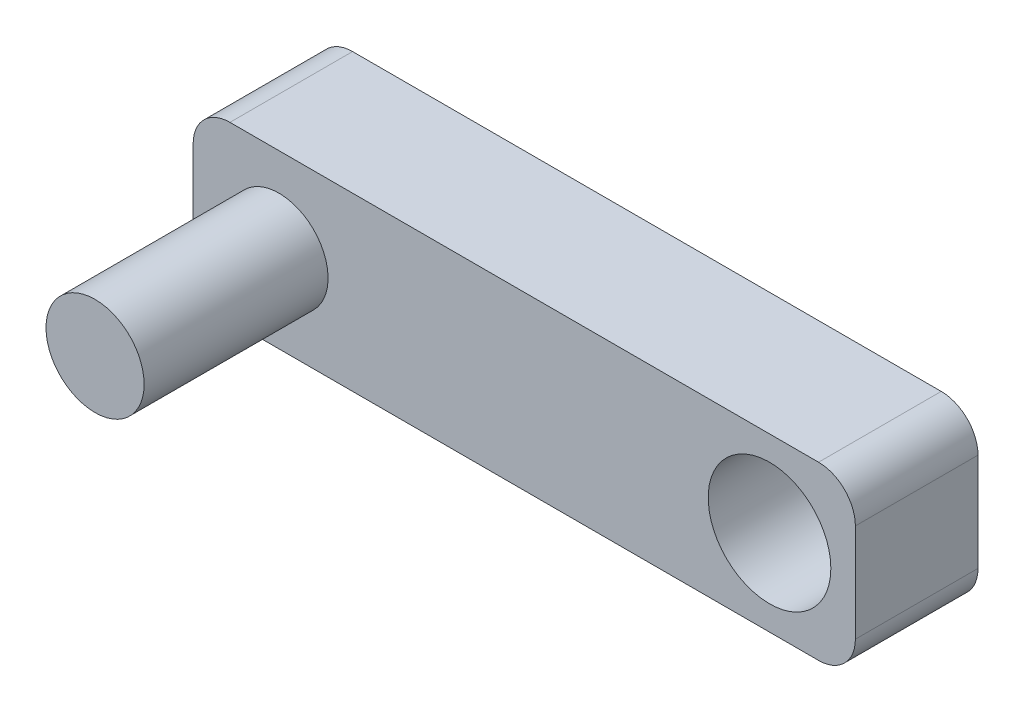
ISO-10303-21;
HEADER;
FILE_DESCRIPTION(('STEP AP214'),'2;1');
FILE_NAME('part.step','',(''),(''),'','','');
FILE_SCHEMA(('AUTOMOTIVE_DESIGN { 1 0 10303 214 1 1 1 1 }'));
ENDSEC;
DATA;
#1=APPLICATION_CONTEXT('core data for automotive mechanical design processes');
#2=APPLICATION_PROTOCOL_DEFINITION('international standard','automotive_design',2000,#1);
#3=PRODUCT_CONTEXT('',#1,'mechanical');
#4=PRODUCT('Part','Part','',(#3));
#5=PRODUCT_RELATED_PRODUCT_CATEGORY('part','',(#4));
#6=PRODUCT_DEFINITION_FORMATION('','',#4);
#7=PRODUCT_DEFINITION_CONTEXT('part definition',#1,'design');
#8=PRODUCT_DEFINITION('design','',#6,#7);
#9=PRODUCT_DEFINITION_SHAPE('','',#8);
#10=(LENGTH_UNIT() NAMED_UNIT(*) SI_UNIT(.MILLI.,.METRE.));
#11=(NAMED_UNIT(*) PLANE_ANGLE_UNIT() SI_UNIT($,.RADIAN.));
#12=(NAMED_UNIT(*) SI_UNIT($,.STERADIAN.) SOLID_ANGLE_UNIT());
#13=UNCERTAINTY_MEASURE_WITH_UNIT(LENGTH_MEASURE(1.E-05),#10,'distance_accuracy_value','');
#14=(GEOMETRIC_REPRESENTATION_CONTEXT(3) GLOBAL_UNCERTAINTY_ASSIGNED_CONTEXT((#13)) GLOBAL_UNIT_ASSIGNED_CONTEXT((#10,
#11,#12)) REPRESENTATION_CONTEXT('',''));
#15=CARTESIAN_POINT('',(0.,0.,0.));
#16=DIRECTION('',(0.,0.,1.));
#17=DIRECTION('',(1.,0.,0.));
#18=AXIS2_PLACEMENT_3D('',#15,#16,#17);
#19=CARTESIAN_POINT('',(0.,140.,100.));
#20=DIRECTION('',(0.,0.,-1.));
#21=DIRECTION('',(-1.,0.,0.));
#22=AXIS2_PLACEMENT_3D('',#19,#20,#21);
#23=PLANE('',#22);
#24=DIRECTION('',(1.,0.,0.));
#25=VECTOR('',#24,1.);
#26=CARTESIAN_POINT('',(0.,0.,100.));
#27=LINE('',#26,#25);
#28=CARTESIAN_POINT('',(30.,0.,100.));
#29=VERTEX_POINT('',#28);
#30=CARTESIAN_POINT('',(510.,0.,100.));
#31=VERTEX_POINT('',#30);
#32=EDGE_CURVE('E173',#29,#31,#27,.T.);
#33=ORIENTED_EDGE('',*,*,#32,.T.);
#34=CARTESIAN_POINT('',(510.,30.,100.));
#35=DIRECTION('',(0.,0.,-1.));
#36=DIRECTION('',(-1.,0.,0.));
#37=AXIS2_PLACEMENT_3D('',#34,#35,#36);
#38=CIRCLE('',#37,30.);
#39=CARTESIAN_POINT('',(540.,30.,100.));
#40=VERTEX_POINT('',#39);
#41=EDGE_CURVE('E150',#31,#40,#38,.F.);
#42=ORIENTED_EDGE('',*,*,#41,.T.);
#43=DIRECTION('',(0.,1.,0.));
#44=VECTOR('',#43,1.);
#45=CARTESIAN_POINT('',(540.,0.,100.));
#46=LINE('',#45,#44);
#47=CARTESIAN_POINT('',(540.,110.,100.));
#48=VERTEX_POINT('',#47);
#49=EDGE_CURVE('E118',#40,#48,#46,.T.);
#50=ORIENTED_EDGE('',*,*,#49,.T.);
#51=CARTESIAN_POINT('',(510.,110.,100.));
#52=DIRECTION('',(0.,0.,-1.));
#53=DIRECTION('',(-1.,0.,0.));
#54=AXIS2_PLACEMENT_3D('',#51,#52,#53);
#55=CIRCLE('',#54,30.);
#56=CARTESIAN_POINT('',(510.,140.,100.));
#57=VERTEX_POINT('',#56);
#58=EDGE_CURVE('E55',#48,#57,#55,.F.);
#59=ORIENTED_EDGE('',*,*,#58,.T.);
#60=DIRECTION('',(-1.,0.,0.));
#61=VECTOR('',#60,1.);
#62=CARTESIAN_POINT('',(0.,140.,100.));
#63=LINE('',#62,#61);
#64=CARTESIAN_POINT('',(30.,140.,100.));
#65=VERTEX_POINT('',#64);
#66=EDGE_CURVE('E136',#57,#65,#63,.T.);
#67=ORIENTED_EDGE('',*,*,#66,.T.);
#68=CARTESIAN_POINT('',(30.,110.,100.));
#69=DIRECTION('',(0.,0.,-1.));
#70=DIRECTION('',(-1.,0.,0.));
#71=AXIS2_PLACEMENT_3D('',#68,#69,#70);
#72=CIRCLE('',#71,30.);
#73=CARTESIAN_POINT('',(0.,110.,100.));
#74=VERTEX_POINT('',#73);
#75=EDGE_CURVE('E145',#65,#74,#72,.F.);
#76=ORIENTED_EDGE('',*,*,#75,.T.);
#77=DIRECTION('',(0.,-1.,0.));
#78=VECTOR('',#77,1.);
#79=CARTESIAN_POINT('',(0.,0.,100.));
#80=LINE('',#79,#78);
#81=CARTESIAN_POINT('',(0.,30.,100.));
#82=VERTEX_POINT('',#81);
#83=EDGE_CURVE('E127',#74,#82,#80,.T.);
#84=ORIENTED_EDGE('',*,*,#83,.T.);
#85=CARTESIAN_POINT('',(30.,30.,100.));
#86=DIRECTION('',(0.,0.,-1.));
#87=DIRECTION('',(-1.,0.,0.));
#88=AXIS2_PLACEMENT_3D('',#85,#86,#87);
#89=CIRCLE('',#88,30.);
#90=EDGE_CURVE('E147',#82,#29,#89,.F.);
#91=ORIENTED_EDGE('',*,*,#90,.T.);
#92=EDGE_LOOP('',(#33,#42,#50,#59,#67,#76,#84,#91));
#93=FACE_BOUND('',#92,.T.);
#94=CARTESIAN_POINT('',(470.,70.,100.));
#95=DIRECTION('',(0.,0.,1.));
#96=DIRECTION('',(1.,0.,0.));
#97=AXIS2_PLACEMENT_3D('',#94,#95,#96);
#98=CIRCLE('',#97,50.);
#99=CARTESIAN_POINT('',(520.,70.,100.));
#100=VERTEX_POINT('',#99);
#101=EDGE_CURVE('E168',#100,#100,#98,.T.);
#102=ORIENTED_EDGE('',*,*,#101,.F.);
#103=EDGE_LOOP('',(#102));
#104=FACE_BOUND('',#103,.T.);
#105=CARTESIAN_POINT('',(70.,70.,100.));
#106=DIRECTION('',(0.,0.,-1.));
#107=DIRECTION('',(-1.,0.,0.));
#108=AXIS2_PLACEMENT_3D('',#105,#106,#107);
#109=CIRCLE('',#108,40.);
#110=CARTESIAN_POINT('',(30.,70.,100.));
#111=VERTEX_POINT('',#110);
#112=EDGE_CURVE('E133',#111,#111,#109,.F.);
#113=ORIENTED_EDGE('',*,*,#112,.F.);
#114=EDGE_LOOP('',(#113));
#115=FACE_BOUND('',#114,.T.);
#116=ADVANCED_FACE('F33',(#93,#104,#115),#23,.F.);
#117=CARTESIAN_POINT('',(0.,0.,100.));
#118=DIRECTION('',(1.,0.,0.));
#119=DIRECTION('',(0.,0.,-1.));
#120=AXIS2_PLACEMENT_3D('',#117,#118,#119);
#121=PLANE('',#120);
#122=DIRECTION('',(0.,-1.,0.));
#123=VECTOR('',#122,1.);
#124=CARTESIAN_POINT('',(0.,0.,0.));
#125=LINE('',#124,#123);
#126=CARTESIAN_POINT('',(0.,110.,0.));
#127=VERTEX_POINT('',#126);
#128=CARTESIAN_POINT('',(0.,30.,0.));
#129=VERTEX_POINT('',#128);
#130=EDGE_CURVE('E129',#127,#129,#125,.T.);
#131=ORIENTED_EDGE('',*,*,#130,.T.);
#132=DIRECTION('',(0.,0.,-1.));
#133=VECTOR('',#132,1.);
#134=CARTESIAN_POINT('',(0.,30.,100.));
#135=LINE('',#134,#133);
#136=EDGE_CURVE('E11',#129,#82,#135,.F.);
#137=ORIENTED_EDGE('',*,*,#136,.T.);
#138=ORIENTED_EDGE('',*,*,#83,.F.);
#139=DIRECTION('',(0.,0.,-1.));
#140=VECTOR('',#139,1.);
#141=CARTESIAN_POINT('',(0.,110.,100.));
#142=LINE('',#141,#140);
#143=EDGE_CURVE('E41',#74,#127,#142,.T.);
#144=ORIENTED_EDGE('',*,*,#143,.T.);
#145=EDGE_LOOP('',(#131,#137,#138,#144));
#146=FACE_BOUND('',#145,.T.);
#147=ADVANCED_FACE('F161',(#146),#121,.F.);
#148=CARTESIAN_POINT('',(0.,0.,100.));
#149=DIRECTION('',(0.,1.,0.));
#150=DIRECTION('',(0.,0.,1.));
#151=AXIS2_PLACEMENT_3D('',#148,#149,#150);
#152=PLANE('',#151);
#153=DIRECTION('',(1.,0.,0.));
#154=VECTOR('',#153,1.);
#155=CARTESIAN_POINT('',(0.,0.,0.));
#156=LINE('',#155,#154);
#157=CARTESIAN_POINT('',(30.,0.,0.));
#158=VERTEX_POINT('',#157);
#159=CARTESIAN_POINT('',(510.,0.,0.));
#160=VERTEX_POINT('',#159);
#161=EDGE_CURVE('E125',#158,#160,#156,.T.);
#162=ORIENTED_EDGE('',*,*,#161,.T.);
#163=DIRECTION('',(0.,0.,-1.));
#164=VECTOR('',#163,1.);
#165=CARTESIAN_POINT('',(510.,0.,100.));
#166=LINE('',#165,#164);
#167=EDGE_CURVE('E104',#160,#31,#166,.F.);
#168=ORIENTED_EDGE('',*,*,#167,.T.);
#169=ORIENTED_EDGE('',*,*,#32,.F.);
#170=DIRECTION('',(0.,0.,-1.));
#171=VECTOR('',#170,1.);
#172=CARTESIAN_POINT('',(30.,0.,100.));
#173=LINE('',#172,#171);
#174=EDGE_CURVE('E109',#29,#158,#173,.T.);
#175=ORIENTED_EDGE('',*,*,#174,.T.);
#176=EDGE_LOOP('',(#162,#168,#169,#175));
#177=FACE_BOUND('',#176,.T.);
#178=ADVANCED_FACE('F197',(#177),#152,.F.);
#179=CARTESIAN_POINT('',(540.,0.,100.));
#180=DIRECTION('',(-1.,0.,0.));
#181=DIRECTION('',(0.,0.,1.));
#182=AXIS2_PLACEMENT_3D('',#179,#180,#181);
#183=PLANE('',#182);
#184=ORIENTED_EDGE('',*,*,#49,.F.);
#185=DIRECTION('',(0.,0.,-1.));
#186=VECTOR('',#185,1.);
#187=CARTESIAN_POINT('',(540.,30.,100.));
#188=LINE('',#187,#186);
#189=CARTESIAN_POINT('',(540.,30.,0.));
#190=VERTEX_POINT('',#189);
#191=EDGE_CURVE('E103',#40,#190,#188,.T.);
#192=ORIENTED_EDGE('',*,*,#191,.T.);
#193=DIRECTION('',(0.,1.,0.));
#194=VECTOR('',#193,1.);
#195=CARTESIAN_POINT('',(540.,0.,0.));
#196=LINE('',#195,#194);
#197=CARTESIAN_POINT('',(540.,110.,0.));
#198=VERTEX_POINT('',#197);
#199=EDGE_CURVE('E116',#190,#198,#196,.T.);
#200=ORIENTED_EDGE('',*,*,#199,.T.);
#201=DIRECTION('',(0.,0.,-1.));
#202=VECTOR('',#201,1.);
#203=CARTESIAN_POINT('',(540.,110.,100.));
#204=LINE('',#203,#202);
#205=EDGE_CURVE('E120',#198,#48,#204,.F.);
#206=ORIENTED_EDGE('',*,*,#205,.T.);
#207=EDGE_LOOP('',(#184,#192,#200,#206));
#208=FACE_BOUND('',#207,.T.);
#209=ADVANCED_FACE('F115',(#208),#183,.F.);
#210=CARTESIAN_POINT('',(0.,140.,100.));
#211=DIRECTION('',(0.,-1.,0.));
#212=DIRECTION('',(0.,0.,-1.));
#213=AXIS2_PLACEMENT_3D('',#210,#211,#212);
#214=PLANE('',#213);
#215=ORIENTED_EDGE('',*,*,#66,.F.);
#216=DIRECTION('',(0.,0.,-1.));
#217=VECTOR('',#216,1.);
#218=CARTESIAN_POINT('',(510.,140.,100.));
#219=LINE('',#218,#217);
#220=CARTESIAN_POINT('',(510.,140.,0.));
#221=VERTEX_POINT('',#220);
#222=EDGE_CURVE('E153',#57,#221,#219,.T.);
#223=ORIENTED_EDGE('',*,*,#222,.T.);
#224=DIRECTION('',(-1.,0.,0.));
#225=VECTOR('',#224,1.);
#226=CARTESIAN_POINT('',(0.,140.,0.));
#227=LINE('',#226,#225);
#228=CARTESIAN_POINT('',(30.,140.,0.));
#229=VERTEX_POINT('',#228);
#230=EDGE_CURVE('E124',#221,#229,#227,.T.);
#231=ORIENTED_EDGE('',*,*,#230,.T.);
#232=DIRECTION('',(0.,0.,-1.));
#233=VECTOR('',#232,1.);
#234=CARTESIAN_POINT('',(30.,140.,100.));
#235=LINE('',#234,#233);
#236=EDGE_CURVE('E48',#229,#65,#235,.F.);
#237=ORIENTED_EDGE('',*,*,#236,.T.);
#238=EDGE_LOOP('',(#215,#223,#231,#237));
#239=FACE_BOUND('',#238,.T.);
#240=ADVANCED_FACE('F204',(#239),#214,.F.);
#241=CARTESIAN_POINT('',(0.,140.,0.));
#242=DIRECTION('',(0.,0.,-1.));
#243=DIRECTION('',(-1.,0.,0.));
#244=AXIS2_PLACEMENT_3D('',#241,#242,#243);
#245=PLANE('',#244);
#246=CARTESIAN_POINT('',(470.,70.,0.));
#247=DIRECTION('',(0.,0.,1.));
#248=DIRECTION('',(1.,0.,0.));
#249=AXIS2_PLACEMENT_3D('',#246,#247,#248);
#250=CIRCLE('',#249,50.);
#251=CARTESIAN_POINT('',(520.,70.,0.));
#252=VERTEX_POINT('',#251);
#253=EDGE_CURVE('E166',#252,#252,#250,.T.);
#254=ORIENTED_EDGE('',*,*,#253,.T.);
#255=EDGE_LOOP('',(#254));
#256=FACE_BOUND('',#255,.T.);
#257=ORIENTED_EDGE('',*,*,#199,.F.);
#258=CARTESIAN_POINT('',(510.,30.,0.));
#259=DIRECTION('',(0.,0.,-1.));
#260=DIRECTION('',(-1.,0.,0.));
#261=AXIS2_PLACEMENT_3D('',#258,#259,#260);
#262=CIRCLE('',#261,30.);
#263=EDGE_CURVE('E99',#190,#160,#262,.T.);
#264=ORIENTED_EDGE('',*,*,#263,.T.);
#265=ORIENTED_EDGE('',*,*,#161,.F.);
#266=CARTESIAN_POINT('',(30.,30.,0.));
#267=DIRECTION('',(0.,0.,-1.));
#268=DIRECTION('',(-1.,0.,0.));
#269=AXIS2_PLACEMENT_3D('',#266,#267,#268);
#270=CIRCLE('',#269,30.);
#271=EDGE_CURVE('E139',#158,#129,#270,.T.);
#272=ORIENTED_EDGE('',*,*,#271,.T.);
#273=ORIENTED_EDGE('',*,*,#130,.F.);
#274=CARTESIAN_POINT('',(30.,110.,0.));
#275=DIRECTION('',(0.,0.,-1.));
#276=DIRECTION('',(-1.,0.,0.));
#277=AXIS2_PLACEMENT_3D('',#274,#275,#276);
#278=CIRCLE('',#277,30.);
#279=EDGE_CURVE('E119',#127,#229,#278,.T.);
#280=ORIENTED_EDGE('',*,*,#279,.T.);
#281=ORIENTED_EDGE('',*,*,#230,.F.);
#282=CARTESIAN_POINT('',(510.,110.,0.));
#283=DIRECTION('',(0.,0.,-1.));
#284=DIRECTION('',(-1.,0.,0.));
#285=AXIS2_PLACEMENT_3D('',#282,#283,#284);
#286=CIRCLE('',#285,30.);
#287=EDGE_CURVE('E110',#221,#198,#286,.T.);
#288=ORIENTED_EDGE('',*,*,#287,.T.);
#289=EDGE_LOOP('',(#257,#264,#265,#272,#273,#280,#281,#288));
#290=FACE_BOUND('',#289,.T.);
#291=ADVANCED_FACE('F122',(#256,#290),#245,.T.);
#292=CARTESIAN_POINT('',(470.,70.,0.));
#293=DIRECTION('',(0.,0.,1.));
#294=DIRECTION('',(1.,0.,0.));
#295=AXIS2_PLACEMENT_3D('',#292,#293,#294);
#296=CYLINDRICAL_SURFACE('',#295,50.);
#297=ORIENTED_EDGE('',*,*,#253,.F.);
#298=EDGE_LOOP('',(#297));
#299=FACE_BOUND('',#298,.T.);
#300=ORIENTED_EDGE('',*,*,#101,.T.);
#301=EDGE_LOOP('',(#300));
#302=FACE_BOUND('',#301,.T.);
#303=ADVANCED_FACE('F188',(#299,#302),#296,.F.);
#304=CARTESIAN_POINT('',(70.,70.,250.));
#305=DIRECTION('',(0.,0.,-1.));
#306=DIRECTION('',(-1.,0.,0.));
#307=AXIS2_PLACEMENT_3D('',#304,#305,#306);
#308=CYLINDRICAL_SURFACE('',#307,40.);
#309=CARTESIAN_POINT('',(70.,70.,250.));
#310=DIRECTION('',(0.,0.,1.));
#311=DIRECTION('',(1.,0.,0.));
#312=AXIS2_PLACEMENT_3D('',#309,#310,#311);
#313=CIRCLE('',#312,40.);
#314=CARTESIAN_POINT('',(110.,70.,250.));
#315=VERTEX_POINT('',#314);
#316=EDGE_CURVE('E178',#315,#315,#313,.T.);
#317=ORIENTED_EDGE('',*,*,#316,.F.);
#318=EDGE_LOOP('',(#317));
#319=FACE_BOUND('',#318,.T.);
#320=ORIENTED_EDGE('',*,*,#112,.T.);
#321=EDGE_LOOP('',(#320));
#322=FACE_BOUND('',#321,.T.);
#323=ADVANCED_FACE('F185',(#319,#322),#308,.T.);
#324=CARTESIAN_POINT('',(70.,70.,250.));
#325=DIRECTION('',(0.,0.,1.));
#326=DIRECTION('',(1.,0.,0.));
#327=AXIS2_PLACEMENT_3D('',#324,#325,#326);
#328=PLANE('',#327);
#329=ORIENTED_EDGE('',*,*,#316,.T.);
#330=EDGE_LOOP('',(#329));
#331=FACE_BOUND('',#330,.T.);
#332=ADVANCED_FACE('F183',(#331),#328,.T.);
#333=CARTESIAN_POINT('',(510.,30.,100.));
#334=DIRECTION('',(0.,0.,-1.));
#335=DIRECTION('',(-1.,0.,0.));
#336=AXIS2_PLACEMENT_3D('',#333,#334,#335);
#337=CYLINDRICAL_SURFACE('',#336,30.);
#338=ORIENTED_EDGE('',*,*,#41,.F.);
#339=ORIENTED_EDGE('',*,*,#167,.F.);
#340=ORIENTED_EDGE('',*,*,#263,.F.);
#341=ORIENTED_EDGE('',*,*,#191,.F.);
#342=EDGE_LOOP('',(#338,#339,#340,#341));
#343=FACE_BOUND('',#342,.T.);
#344=ADVANCED_FACE('F102',(#343),#337,.T.);
#345=CARTESIAN_POINT('',(510.,110.,100.));
#346=DIRECTION('',(0.,0.,-1.));
#347=DIRECTION('',(-1.,0.,0.));
#348=AXIS2_PLACEMENT_3D('',#345,#346,#347);
#349=CYLINDRICAL_SURFACE('',#348,30.);
#350=ORIENTED_EDGE('',*,*,#58,.F.);
#351=ORIENTED_EDGE('',*,*,#205,.F.);
#352=ORIENTED_EDGE('',*,*,#287,.F.);
#353=ORIENTED_EDGE('',*,*,#222,.F.);
#354=EDGE_LOOP('',(#350,#351,#352,#353));
#355=FACE_BOUND('',#354,.T.);
#356=ADVANCED_FACE('F215',(#355),#349,.T.);
#357=CARTESIAN_POINT('',(30.,30.,100.));
#358=DIRECTION('',(0.,0.,-1.));
#359=DIRECTION('',(-1.,0.,0.));
#360=AXIS2_PLACEMENT_3D('',#357,#358,#359);
#361=CYLINDRICAL_SURFACE('',#360,30.);
#362=ORIENTED_EDGE('',*,*,#90,.F.);
#363=ORIENTED_EDGE('',*,*,#136,.F.);
#364=ORIENTED_EDGE('',*,*,#271,.F.);
#365=ORIENTED_EDGE('',*,*,#174,.F.);
#366=EDGE_LOOP('',(#362,#363,#364,#365));
#367=FACE_BOUND('',#366,.T.);
#368=ADVANCED_FACE('F217',(#367),#361,.T.);
#369=CARTESIAN_POINT('',(30.,110.,100.));
#370=DIRECTION('',(0.,0.,-1.));
#371=DIRECTION('',(-1.,0.,0.));
#372=AXIS2_PLACEMENT_3D('',#369,#370,#371);
#373=CYLINDRICAL_SURFACE('',#372,30.);
#374=ORIENTED_EDGE('',*,*,#75,.F.);
#375=ORIENTED_EDGE('',*,*,#236,.F.);
#376=ORIENTED_EDGE('',*,*,#279,.F.);
#377=ORIENTED_EDGE('',*,*,#143,.F.);
#378=EDGE_LOOP('',(#374,#375,#376,#377));
#379=FACE_BOUND('',#378,.T.);
#380=ADVANCED_FACE('F35',(#379),#373,.T.);
#381=CLOSED_SHELL('',(#116,#147,#178,#209,#240,#291,#303,#323,#332,#344,#356,#368,#380));
#382=MANIFOLD_SOLID_BREP('B2',#381);
#383=ADVANCED_BREP_SHAPE_REPRESENTATION('',(#18,#382),#14);
#384=SHAPE_DEFINITION_REPRESENTATION(#9,#383);
ENDSEC;
END-ISO-10303-21;
